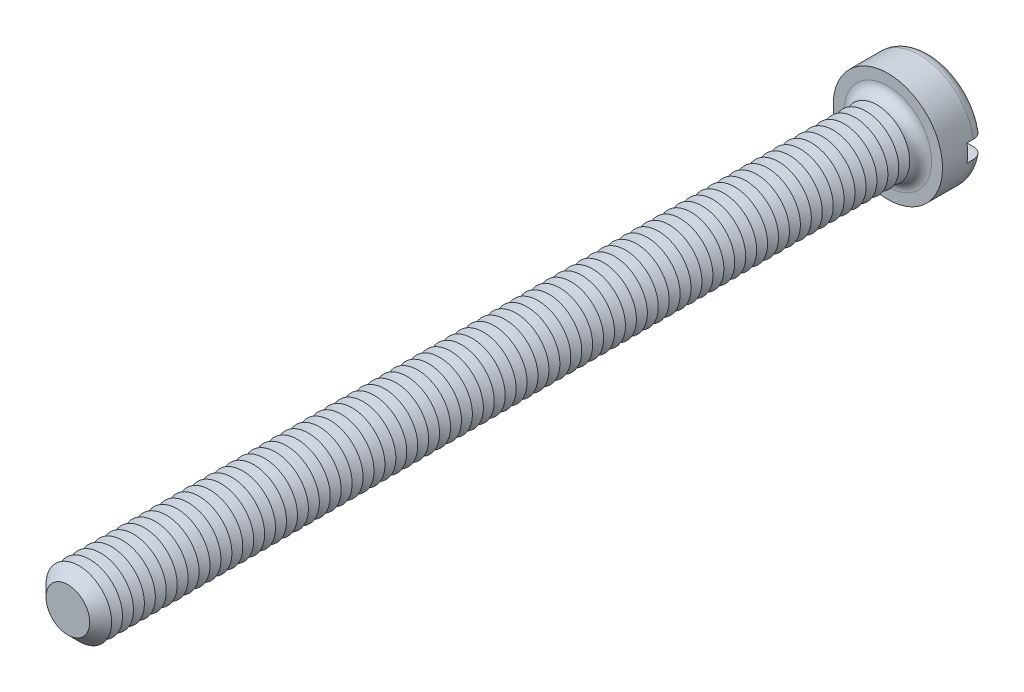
from build123d import *

# Parameters (mm, degrees)
SKETCH3_R           = 5
BOSS_EXTRUDE2_DEPTH = 3.9
SKETCH4_R           = 3
BOSS_EXTRUDE3_DEPTH = 75
FILLET1_R           = 1
CHAMFER1_SIZE       = 1
LPATTERN1_COUNT     = 73
LPATTERN1_PITCH     = 1
SKETCH8_W           = 10
SKETCH8_H           = 1.6
CUT_EXTRUDE1_DEPTH  = 1.6


with BuildPart() as part:
    # Sketch3 → Boss-Extrude2 (new body)
    with BuildSketch(Plane.XY):
        Circle(SKETCH3_R)
    extrude(amount=-BOSS_EXTRUDE2_DEPTH)

    # Sketch4 → Boss-Extrude3 (add)
    with BuildSketch(Plane.XY):
        Circle(SKETCH4_R)
    extrude(amount=BOSS_EXTRUDE3_DEPTH)

    # Fillet1
    fillet1_edges = [part.edges().sort_by_distance(p)[0] for p in [
        (-5, 0, -3.9),
        (-3, 0, 0),
    ]]
    fillet(fillet1_edges, radius=FILLET1_R)

    # Chamfer1
    chamfer1_edges = [part.edges().sort_by_distance(p)[0] for p in [
        (-3, 0, 75),
    ]]
    chamfer(chamfer1_edges, length=CHAMFER1_SIZE)

    # Sketch6 → Cut-Revolve1 (revolve, cut)
    with BuildSketch(Plane(origin=(0, 0, 0), x_dir=(0, 0, -1), z_dir=(1, 0, 0)), mode=Mode.PRIVATE) as cut_revolve1_sk:
        Polygon((-1, 3), (-1.5, 2.133974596), (-2, 3), align=None)
    cut_revolve1 = revolve(cut_revolve1_sk.sketch.rotate(Axis((0, 0, -1.694361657), (0, 0, 1)), 90), axis=Axis((0, 0, -1.694361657), (0, 0, 1)), mode=Mode.SUBTRACT)

    # LPattern1: Cut-Revolve1 ×73
    with Locations(*[(0, 0, i * LPATTERN1_PITCH) for i in range(1, LPATTERN1_COUNT)]):
        add(cut_revolve1, mode=Mode.SUBTRACT)

    # Sketch8 → Cut-Extrude1 (cut)
    with BuildSketch(Plane(origin=(0, 0, -3.9), x_dir=(-1, 0, 0), z_dir=(0, 0, -1))):
        Rectangle(SKETCH8_W, SKETCH8_H)
    extrude(amount=-CUT_EXTRUDE1_DEPTH, mode=Mode.SUBTRACT)


solid = part.part
